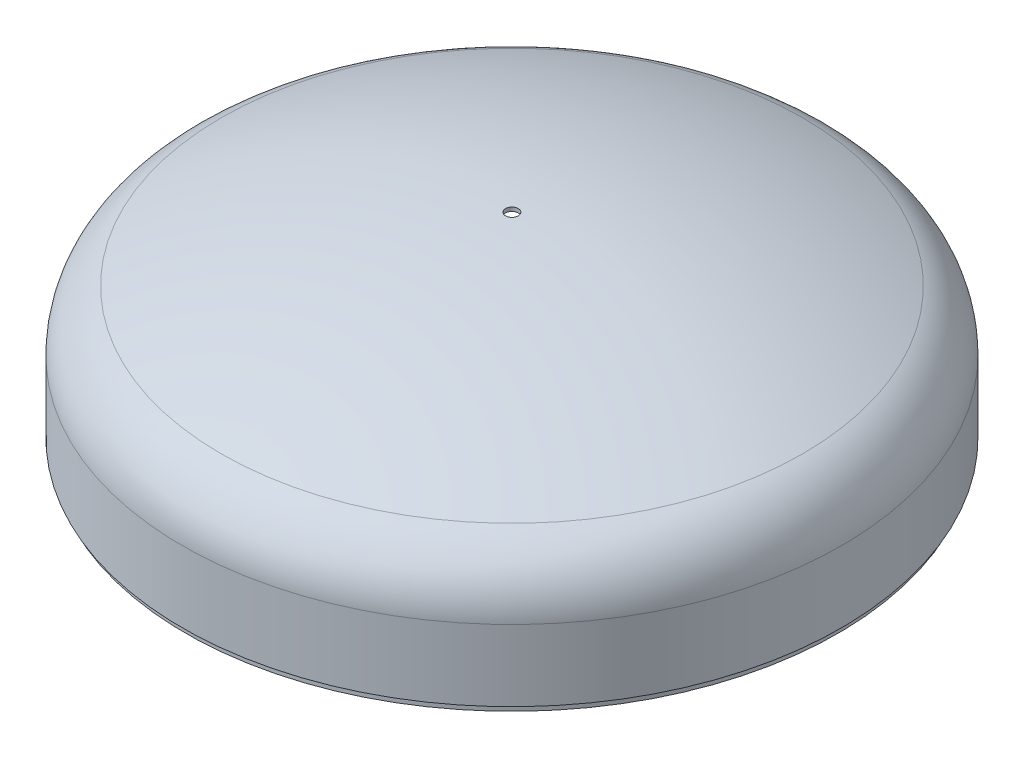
ISO-10303-21;
HEADER;
FILE_DESCRIPTION(('STEP AP214'),'2;1');
FILE_NAME('part.step','',(''),(''),'','','');
FILE_SCHEMA(('AUTOMOTIVE_DESIGN { 1 0 10303 214 1 1 1 1 }'));
ENDSEC;
DATA;
#1=APPLICATION_CONTEXT('core data for automotive mechanical design processes');
#2=APPLICATION_PROTOCOL_DEFINITION('international standard','automotive_design',2000,#1);
#3=PRODUCT_CONTEXT('',#1,'mechanical');
#4=PRODUCT('Part','Part','',(#3));
#5=PRODUCT_RELATED_PRODUCT_CATEGORY('part','',(#4));
#6=PRODUCT_DEFINITION_FORMATION('','',#4);
#7=PRODUCT_DEFINITION_CONTEXT('part definition',#1,'design');
#8=PRODUCT_DEFINITION('design','',#6,#7);
#9=PRODUCT_DEFINITION_SHAPE('','',#8);
#10=(LENGTH_UNIT() NAMED_UNIT(*) SI_UNIT(.MILLI.,.METRE.));
#11=(NAMED_UNIT(*) PLANE_ANGLE_UNIT() SI_UNIT($,.RADIAN.));
#12=(NAMED_UNIT(*) SI_UNIT($,.STERADIAN.) SOLID_ANGLE_UNIT());
#13=UNCERTAINTY_MEASURE_WITH_UNIT(LENGTH_MEASURE(1.E-05),#10,'distance_accuracy_value','');
#14=(GEOMETRIC_REPRESENTATION_CONTEXT(3) GLOBAL_UNCERTAINTY_ASSIGNED_CONTEXT((#13)) GLOBAL_UNIT_ASSIGNED_CONTEXT((#10,
#11,#12)) REPRESENTATION_CONTEXT('',''));
#15=CARTESIAN_POINT('',(0.,0.,0.));
#16=DIRECTION('',(0.,0.,1.));
#17=DIRECTION('',(1.,0.,0.));
#18=AXIS2_PLACEMENT_3D('',#15,#16,#17);
#19=CARTESIAN_POINT('',(0.,0.,0.));
#20=DIRECTION('',(0.,-1.,0.));
#21=DIRECTION('',(1.,0.,0.));
#22=AXIS2_PLACEMENT_3D('',#19,#20,#21);
#23=SPHERICAL_SURFACE('',#22,1100.);
#24=CARTESIAN_POINT('',(0.,1099.95454451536,0.));
#25=DIRECTION('',(0.,-1.,0.));
#26=DIRECTION('',(0.,0.,-1.));
#27=AXIS2_PLACEMENT_3D('',#24,#25,#26);
#28=CIRCLE('',#27,10.);
#29=CARTESIAN_POINT('',(10.0000000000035,1099.95454451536,0.));
#30=VERTEX_POINT('',#29);
#31=EDGE_CURVE('E102',#30,#30,#28,.F.);
#32=CARTESIAN_POINT('',(0.,999.24594180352,0.));
#33=DIRECTION('',(0.,-1.,0.));
#34=DIRECTION('',(0.,0.,-1.));
#35=AXIS2_PLACEMENT_3D('',#32,#33,#34);
#36=CIRCLE('',#35,459.899497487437);
#37=CARTESIAN_POINT('',(459.899497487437,999.24594180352,-1.94024584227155E-12));
#38=VERTEX_POINT('',#37);
#39=EDGE_CURVE('E98',#38,#38,#36,.T.);
#40=CARTESIAN_POINT('',(10.0000000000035,1099.95454451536,0.));
#41=CARTESIAN_POINT('',(14.8380948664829,1099.91056201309,0.));
#42=CARTESIAN_POINT('',(19.6758994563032,1099.83465541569,0.));
#43=CARTESIAN_POINT('',(29.3500859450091,1099.6190160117,-1.2382353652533E-13));
#44=CARTESIAN_POINT('',(34.1864678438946,1099.47928320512,-1.44227494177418E-13));
#45=CARTESIAN_POINT('',(43.8569668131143,1099.13601336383,-1.85025854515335E-13));
#46=CARTESIAN_POINT('',(48.6910838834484,1098.93247632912,-2.05420257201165E-13));
#47=CARTESIAN_POINT('',(58.3562115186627,1098.46163409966,-2.46195956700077E-13));
#48=CARTESIAN_POINT('',(63.1872220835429,1098.1943289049,-2.66577253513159E-13));
#49=CARTESIAN_POINT('',(72.8452955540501,1097.59599672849,-3.07323192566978E-13));
#50=CARTESIAN_POINT('',(77.6723584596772,1097.26496974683,-3.27687834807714E-13));
#51=CARTESIAN_POINT('',(87.3216961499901,1096.53925167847,-3.68396918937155E-13));
#52=CARTESIAN_POINT('',(92.1439709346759,1096.14456059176,-3.8874136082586E-13));
#53=CARTESIAN_POINT('',(101.782892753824,1095.29158302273,-4.29406501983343E-13));
#54=CARTESIAN_POINT('',(106.599539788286,1094.83329654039,-4.49727201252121E-13));
#55=CARTESIAN_POINT('',(116.226367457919,1093.85320797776,-4.90341319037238E-13));
#56=CARTESIAN_POINT('',(121.036548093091,1093.33140589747,-5.10634737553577E-13));
#57=CARTESIAN_POINT('',(130.649605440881,1092.22437699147,-5.51190760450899E-13));
#58=CARTESIAN_POINT('',(135.452482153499,1091.63915016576,-5.71453364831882E-13));
#59=CARTESIAN_POINT('',(145.050095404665,1090.40537366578,-6.11944231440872E-13));
#60=CARTESIAN_POINT('',(149.844831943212,1089.7568239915,-6.32172493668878E-13));
#61=CARTESIAN_POINT('',(159.425330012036,1088.39651471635,-6.72591153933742E-13));
#62=CARTESIAN_POINT('',(164.211091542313,1087.68475511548,-6.92781551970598E-13));
#63=CARTESIAN_POINT('',(173.772806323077,1086.19814991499,-7.33120968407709E-13));
#64=CARTESIAN_POINT('',(178.548759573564,1085.42330431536,-7.53269986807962E-13));
#65=CARTESIAN_POINT('',(188.090026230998,1083.81066202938,-7.93523135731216E-13));
#66=CARTESIAN_POINT('',(192.855339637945,1082.97286534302,-8.13627266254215E-13));
#67=CARTESIAN_POINT('',(202.374496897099,1081.2344667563,-8.53787138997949E-13));
#68=CARTESIAN_POINT('',(207.128340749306,1080.33386485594,-8.73842881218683E-13));
#69=CARTESIAN_POINT('',(216.623731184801,1078.47001264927,-9.13902485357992E-13));
#70=CARTESIAN_POINT('',(221.365277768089,1077.50676234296,-9.33906347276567E-13));
#71=CARTESIAN_POINT('',(230.835248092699,1075.51778104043,-9.73858707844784E-13));
#72=CARTESIAN_POINT('',(235.563671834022,1074.49205004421,-9.93807206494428E-13));
#73=CARTESIAN_POINT('',(245.006573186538,1072.37828595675,-1.03364536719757E-12));
#74=CARTESIAN_POINT('',(249.721050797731,1071.2902528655,-1.05353502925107E-12));
#75=CARTESIAN_POINT('',(259.13523903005,1069.05207403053,-1.09325205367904E-12));
#76=CARTESIAN_POINT('',(263.834949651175,1067.90192828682,-1.1130794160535E-12));
#77=CARTESIAN_POINT('',(273.21878561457,1065.53972440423,-1.1526683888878E-12));
#78=CARTESIAN_POINT('',(277.902910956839,1064.32766626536,-1.17242999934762E-12));
#79=CARTESIAN_POINT('',(287.254760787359,1061.84184862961,-1.21188402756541E-12));
#80=CARTESIAN_POINT('',(291.922485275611,1060.56808913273,-1.23157644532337E-12));
#81=CARTESIAN_POINT('',(301.240720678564,1057.95909056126,-1.27088865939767E-12));
#82=CARTESIAN_POINT('',(305.891231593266,1056.62385148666,-1.290508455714E-12));
#83=CARTESIAN_POINT('',(315.174230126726,1053.89212624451,-1.32967201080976E-12));
#84=CARTESIAN_POINT('',(319.806717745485,1052.49564007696,-1.34921576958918E-12));
#85=CARTESIAN_POINT('',(329.052863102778,1049.6416637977,-1.38822384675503E-12));
#86=CARTESIAN_POINT('',(333.666520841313,1048.18417368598,-1.40768816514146E-12));
#87=CARTESIAN_POINT('',(342.874203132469,1045.20844328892,-1.44653397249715E-12));
#88=CARTESIAN_POINT('',(347.46822768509,1043.69020300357,-1.4659154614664E-12));
#89=CARTESIAN_POINT('',(356.635843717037,1040.59323660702,-1.50459223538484E-12));
#90=CARTESIAN_POINT('',(361.209435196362,1039.0145104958,-1.52388752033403E-12));
#91=CARTESIAN_POINT('',(370.335388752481,1035.79684732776,-1.56238852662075E-12));
#92=CARTESIAN_POINT('',(374.887750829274,1034.15791027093,-1.58159424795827E-12));
#93=CARTESIAN_POINT('',(383.970452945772,1030.82011057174,-1.61991278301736E-12));
#94=CARTESIAN_POINT('',(388.500792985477,1029.12124792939,-1.63902559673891E-12));
#95=CARTESIAN_POINT('',(397.53866223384,1025.66389286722,-1.67715498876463E-12));
#96=CARTESIAN_POINT('',(402.046191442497,1023.90540044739,-1.69617156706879E-12));
#97=CARTESIAN_POINT('',(411.037654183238,1020.3290919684,-1.73410517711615E-12));
#98=CARTESIAN_POINT('',(415.521587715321,1018.51127590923,-1.75302220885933E-12));
#99=CARTESIAN_POINT('',(424.465078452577,1014.81663681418,-1.79075343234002E-12));
#100=CARTESIAN_POINT('',(428.92463565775,1012.93981377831,-1.80956762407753E-12));
#101=CARTESIAN_POINT('',(437.818597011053,1009.12748693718,-1.84708989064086E-12));
#102=CARTESIAN_POINT('',(442.253001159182,1007.19198313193,-1.8657979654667E-12));
#103=CARTESIAN_POINT('',(451.095885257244,1003.2626338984,-1.90310474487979E-12));
#104=CARTESIAN_POINT('',(455.504365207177,1001.26878847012,-1.92170344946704E-12));
#105=CARTESIAN_POINT('',(459.899497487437,999.24594180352,-1.94024584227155E-12));
#106=B_SPLINE_CURVE_WITH_KNOTS('',3,(#40,#41,#42,#43,#44,#45,#46,#47,#48,#49,#50,#51,#52,#53,
#54,#55,#56,#57,#58,#59,#60,#61,#62,#63,#64,#65,#66,#67,#68,#69,#70,#71,#72,#73,#74,#75,#76,#77,
#78,#79,#80,#81,#82,#83,#84,#85,#86,#87,#88,#89,#90,#91,#92,#93,#94,#95,#96,#97,#98,#99,#100,
#101,#102,#103,#104,#105),.UNSPECIFIED.,.F.,.F.,(4,2,2,2,2,2,2,2,2,2,2,2,2,2,2,2,2,2,2,2,2,2,2,
2,2,2,2,2,2,2,2,2,4),(0.,14.5147789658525,29.029557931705,43.5443368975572,58.0591158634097,
72.5738948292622,87.0886737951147,101.603452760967,116.118231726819,130.633010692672,
145.147789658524,159.662568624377,174.177347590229,188.692126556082,203.206905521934,
217.721684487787,232.236463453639,246.751242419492,261.266021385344,275.780800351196,
290.295579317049,304.810358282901,319.325137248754,333.839916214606,348.354695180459,
362.869474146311,377.384253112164,391.899032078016,406.413811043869,420.928590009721,
435.443368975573,449.958147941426,464.472926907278),.UNSPECIFIED.);
#107=EDGE_CURVE('BSEAM50',#30,#38,#106,.T.);
#108=ORIENTED_EDGE('',*,*,#31,.F.);
#109=ORIENTED_EDGE('',*,*,#39,.F.);
#110=ORIENTED_EDGE('',*,*,#107,.T.);
#111=ORIENTED_EDGE('',*,*,#107,.F.);
#112=EDGE_LOOP('',(#108,#110,#109,#111));
#113=FACE_BOUND('',#112,.T.);
#114=ADVANCED_FACE('F50',(#113),#23,.T.);
#115=CARTESIAN_POINT('',(0.,0.,0.));
#116=DIRECTION('',(0.,-1.,0.));
#117=DIRECTION('',(1.,0.,0.));
#118=AXIS2_PLACEMENT_3D('',#115,#116,#117);
#119=SPHERICAL_SURFACE('',#118,1094.);
#120=CARTESIAN_POINT('',(0.,1093.95429520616,0.));
#121=DIRECTION('',(0.,-1.,0.));
#122=DIRECTION('',(0.,0.,-1.));
#123=AXIS2_PLACEMENT_3D('',#120,#121,#122);
#124=CIRCLE('',#123,10.);
#125=CARTESIAN_POINT('',(10.0000000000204,1093.95429520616,0.));
#126=VERTEX_POINT('',#125);
#127=EDGE_CURVE('E53',#126,#126,#124,.F.);
#128=CARTESIAN_POINT('',(0.,995.859022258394,0.));
#129=DIRECTION('',(0.,-1.,0.));
#130=DIRECTION('',(0.,0.,-1.));
#131=AXIS2_PLACEMENT_3D('',#128,#129,#130);
#132=CIRCLE('',#131,452.880566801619);
#133=CARTESIAN_POINT('',(452.88056680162,995.859022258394,-1.91063404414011E-12));
#134=VERTEX_POINT('',#133);
#135=EDGE_CURVE('E12',#134,#134,#132,.T.);
#136=CARTESIAN_POINT('',(10.0000000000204,1093.95429520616,0.));
#137=CARTESIAN_POINT('',(14.7594702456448,1093.91079007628,0.));
#138=CARTESIAN_POINT('',(19.5186564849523,1093.83622065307,0.));
#139=CARTESIAN_POINT('',(29.0356503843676,1093.62497426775,-1.22496980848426E-13));
#140=CARTESIAN_POINT('',(33.7934580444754,1093.48829730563,-1.42569445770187E-13));
#141=CARTESIAN_POINT('',(43.3068842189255,1093.1528568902,-1.82705139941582E-13));
#142=CARTESIAN_POINT('',(48.0625027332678,1092.95409343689,-2.02768369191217E-13));
#143=CARTESIAN_POINT('',(57.5707404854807,1092.49451449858,-2.42882174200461E-13));
#144=CARTESIAN_POINT('',(62.3233597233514,1092.23369901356,-2.62932749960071E-13));
#145=CARTESIAN_POINT('',(71.8247892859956,1091.65006028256,-3.03017832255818E-13));
#146=CARTESIAN_POINT('',(76.5735996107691,1091.32723703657,-3.23052338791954E-13));
#147=CARTESIAN_POINT('',(86.0666023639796,1090.61963782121,-3.63101869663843E-13));
#148=CARTESIAN_POINT('',(90.8107947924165,1090.23486185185,-3.83116893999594E-13));
#149=CARTESIAN_POINT('',(100.293753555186,1089.40342272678,-4.23124050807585E-13));
#150=CARTESIAN_POINT('',(105.032519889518,1088.95675957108,-4.43116183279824E-13));
#151=CARTESIAN_POINT('',(114.503819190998,1088.00162216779,-4.83074150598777E-13));
#152=CARTESIAN_POINT('',(119.236352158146,1087.4931479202,-5.03039985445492E-13));
#153=CARTESIAN_POINT('',(128.694378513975,1086.4144749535,-5.42941956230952E-13));
#154=CARTESIAN_POINT('',(133.419871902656,1085.84427623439,-5.62878092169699E-13));
#155=CARTESIAN_POINT('',(142.863014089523,1084.64225146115,-6.02717268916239E-13));
#156=CARTESIAN_POINT('',(147.580662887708,1084.01042540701,-6.22620309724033E-13));
#157=CARTESIAN_POINT('',(157.007312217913,1082.68525359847,-6.62389905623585E-13));
#158=CARTESIAN_POINT('',(161.716312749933,1081.99190784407,-6.82256460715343E-13));
#159=CARTESIAN_POINT('',(171.124863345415,1080.54381475,-7.21949700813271E-13));
#160=CARTESIAN_POINT('',(175.824413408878,1079.78906741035,-7.41776385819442E-13));
#161=CARTESIAN_POINT('',(185.213262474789,1078.21829972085,-7.81386508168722E-13));
#162=CARTESIAN_POINT('',(189.902561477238,1077.40227937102,-8.01169945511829E-13));
#163=CARTESIAN_POINT('',(199.270109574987,1075.70910467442,-8.40690202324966E-13));
#164=CARTESIAN_POINT('',(203.948358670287,1074.83195032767,-8.60427021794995E-13));
#165=CARTESIAN_POINT('',(213.293009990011,1073.01665706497,-8.99850680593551E-13));
#166=CARTESIAN_POINT('',(217.959412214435,1072.07851814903,-9.19537519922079E-13));
#167=CARTESIAN_POINT('',(227.279574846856,1070.14141556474,-9.58857864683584E-13));
#168=CARTESIAN_POINT('',(231.933335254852,1069.1424518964,-9.78491370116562E-13));
#169=CARTESIAN_POINT('',(241.227421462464,1067.08386998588,-1.01770170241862E-12));
#170=CARTESIAN_POINT('',(245.86774726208,1066.02425174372,-1.0372785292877E-12));
#171=CARTESIAN_POINT('',(255.134173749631,1063.84454119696,-1.07637216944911E-12));
#172=CARTESIAN_POINT('',(259.760274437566,1062.72444889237,-1.09588898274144E-12));
#173=CARTESIAN_POINT('',(268.997462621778,1060.42398103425,-1.13485927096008E-12));
#174=CARTESIAN_POINT('',(273.608550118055,1059.24360548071,-1.15431274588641E-12));
#175=CARTESIAN_POINT('',(282.814926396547,1056.82277220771,-1.19315304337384E-12));
#176=CARTESIAN_POINT('',(287.410215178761,1055.58231448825,-1.21253986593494E-12));
#177=CARTESIAN_POINT('',(296.584211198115,1053.04152820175,-1.25124355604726E-12));
#178=CARTESIAN_POINT('',(301.162918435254,1051.7411996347,-1.27056042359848E-12));
#179=CARTESIAN_POINT('',(310.302971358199,1049.08089317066,-1.3091209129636E-12));
#180=CARTESIAN_POINT('',(314.864317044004,1047.72091527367,-1.32836453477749E-12));
#181=CARTESIAN_POINT('',(323.968869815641,1044.94154182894,-1.36677525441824E-12));
#182=CARTESIAN_POINT('',(328.512076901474,1043.5221462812,-1.3859423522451E-12));
#183=CARTESIAN_POINT('',(337.579578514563,1040.62417933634,-1.42419675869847E-12));
#184=CARTESIAN_POINT('',(342.103873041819,1039.14560793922,-1.44328406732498E-12));
#185=CARTESIAN_POINT('',(351.13277880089,1036.12954117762,-1.48137564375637E-12));
#186=CARTESIAN_POINT('',(355.637390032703,1034.59204581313,-1.50037991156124E-12));
#187=CARTESIAN_POINT('',(364.626161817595,1031.45839303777,-1.53830216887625E-12));
#188=CARTESIAN_POINT('',(369.110322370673,1029.8622356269,-1.5572201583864E-12));
#189=CARTESIAN_POINT('',(378.057428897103,1026.61153066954,-1.59496663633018E-12));
#190=CARTESIAN_POINT('',(382.520374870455,1024.95698312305,-1.61379512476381E-12));
#191=CARTESIAN_POINT('',(391.424291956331,1021.58977976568,-1.65135939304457E-12));
#192=CARTESIAN_POINT('',(395.865263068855,1019.8771239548,-1.67009517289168E-12));
#193=CARTESIAN_POINT('',(404.724473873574,1016.39399578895,-1.70747083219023E-12));
#194=CARTESIAN_POINT('',(409.142713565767,1014.62352343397,-1.72611071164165E-12));
#195=CARTESIAN_POINT('',(417.955708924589,1011.025063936,-1.76329139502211E-12));
#196=CARTESIAN_POINT('',(422.350464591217,1009.197076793,-1.78183219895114E-12));
#197=CARTESIAN_POINT('',(431.11574298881,1005.48389857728,-1.81881157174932E-12));
#198=CARTESIAN_POINT('',(435.486265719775,1003.59870750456,-1.83725014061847E-12));
#199=CARTESIAN_POINT('',(444.202334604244,999.771444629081,-1.87402190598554E-12));
#200=CARTESIAN_POINT('',(448.547880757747,997.829372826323,-1.89235510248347E-12));
#201=CARTESIAN_POINT('',(452.88056680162,995.859022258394,-1.91063404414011E-12));
#202=B_SPLINE_CURVE_WITH_KNOTS('',3,(#136,#137,#138,#139,#140,#141,#142,#143,#144,#145,#146,
#147,#148,#149,#150,#151,#152,#153,#154,#155,#156,#157,#158,#159,#160,#161,#162,#163,#164,#165,
#166,#167,#168,#169,#170,#171,#172,#173,#174,#175,#176,#177,#178,#179,#180,#181,#182,#183,#184,
#185,#186,#187,#188,#189,#190,#191,#192,#193,#194,#195,#196,#197,#198,#199,#200,#201),
.UNSPECIFIED.,.F.,.F.,(4,2,2,2,2,2,2,2,2,2,2,2,2,2,2,2,2,2,2,2,2,2,2,2,2,2,2,2,2,2,2,2,4),(0.,
14.2789058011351,28.5578116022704,42.8367174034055,57.1156232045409,71.394529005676,
85.6734348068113,99.9523406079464,114.231246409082,128.510152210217,142.789058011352,
157.067963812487,171.346869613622,185.625775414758,199.904681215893,214.183587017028,
228.462492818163,242.741398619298,257.020304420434,271.299210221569,285.578116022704,
299.857021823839,314.135927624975,328.41483342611,342.693739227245,356.97264502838,
371.251550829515,385.530456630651,399.809362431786,414.088268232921,428.367174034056,
442.646079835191,456.924985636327),.UNSPECIFIED.);
#203=EDGE_CURVE('BSEAM113',#126,#134,#202,.T.);
#204=ORIENTED_EDGE('',*,*,#127,.T.);
#205=ORIENTED_EDGE('',*,*,#135,.T.);
#206=ORIENTED_EDGE('',*,*,#203,.T.);
#207=ORIENTED_EDGE('',*,*,#203,.F.);
#208=EDGE_LOOP('',(#204,#206,#205,#207));
#209=FACE_BOUND('',#208,.T.);
#210=ADVANCED_FACE('F113',(#209),#119,.F.);
#211=CARTESIAN_POINT('',(-1.31838984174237E-13,899.368111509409,0.));
#212=DIRECTION('',(0.,-1.,0.));
#213=DIRECTION('',(0.,0.,-1.));
#214=AXIS2_PLACEMENT_3D('',#211,#212,#213);
#215=TOROIDAL_SURFACE('',#214,409.,106.);
#216=CARTESIAN_POINT('',(-1.31838984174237E-13,899.368111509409,0.));
#217=DIRECTION('',(0.,-1.,0.));
#218=DIRECTION('',(0.,0.,-1.));
#219=AXIS2_PLACEMENT_3D('',#216,#217,#218);
#220=CIRCLE('',#219,515.);
#221=CARTESIAN_POINT('',(2.04086747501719E-12,899.368111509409,-515.));
#222=VERTEX_POINT('',#221);
#223=EDGE_CURVE('E58',#222,#222,#220,.T.);
#224=ORIENTED_EDGE('',*,*,#223,.T.);
#225=EDGE_LOOP('',(#224));
#226=FACE_BOUND('',#225,.T.);
#227=ORIENTED_EDGE('',*,*,#135,.F.);
#228=EDGE_LOOP('',(#227));
#229=FACE_BOUND('',#228,.T.);
#230=ADVANCED_FACE('F130',(#226,#229),#215,.F.);
#231=CARTESIAN_POINT('',(0.,0.,0.));
#232=DIRECTION('',(0.,-1.,0.));
#233=DIRECTION('',(0.,0.,-1.));
#234=AXIS2_PLACEMENT_3D('',#231,#232,#233);
#235=CYLINDRICAL_SURFACE('',#234,515.);
#236=CARTESIAN_POINT('',(0.,793.374314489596,0.));
#237=DIRECTION('',(0.,-1.,0.));
#238=DIRECTION('',(0.,0.,-1.));
#239=AXIS2_PLACEMENT_3D('',#236,#237,#238);
#240=CIRCLE('',#239,515.);
#241=CARTESIAN_POINT('',(2.17270645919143E-12,793.374314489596,-515.));
#242=VERTEX_POINT('',#241);
#243=EDGE_CURVE('E64',#242,#242,#240,.T.);
#244=ORIENTED_EDGE('',*,*,#243,.T.);
#245=EDGE_LOOP('',(#244));
#246=FACE_BOUND('',#245,.T.);
#247=ORIENTED_EDGE('',*,*,#223,.F.);
#248=EDGE_LOOP('',(#247));
#249=FACE_BOUND('',#248,.T.);
#250=ADVANCED_FACE('F137',(#246,#249),#235,.F.);
#251=CARTESIAN_POINT('',(0.,791.240339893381,0.));
#252=DIRECTION('',(0.,1.,0.));
#253=DIRECTION('',(0.,0.,1.));
#254=AXIS2_PLACEMENT_3D('',#251,#252,#253);
#255=CONICAL_SURFACE('',#254,511.303847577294,1.04719755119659);
#256=ORIENTED_EDGE('',*,*,#243,.F.);
#257=EDGE_LOOP('',(#256));
#258=FACE_BOUND('',#257,.T.);
#259=CARTESIAN_POINT('',(0.,791.240339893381,0.));
#260=DIRECTION('',(0.,-1.,0.));
#261=DIRECTION('',(0.,0.,-1.));
#262=AXIS2_PLACEMENT_3D('',#259,#260,#261);
#263=CIRCLE('',#262,511.303847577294);
#264=CARTESIAN_POINT('',(2.15711295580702E-12,791.240339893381,-511.303847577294));
#265=VERTEX_POINT('',#264);
#266=EDGE_CURVE('E70',#265,#265,#263,.T.);
#267=ORIENTED_EDGE('',*,*,#266,.T.);
#268=EDGE_LOOP('',(#267));
#269=FACE_BOUND('',#268,.T.);
#270=ADVANCED_FACE('F143',(#258,#269),#255,.F.);
#271=CARTESIAN_POINT('',(0.,788.642263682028,0.));
#272=DIRECTION('',(0.,-1.,0.));
#273=DIRECTION('',(0.,0.,-1.));
#274=AXIS2_PLACEMENT_3D('',#271,#272,#273);
#275=TOROIDAL_SURFACE('',#274,512.803847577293,2.99999999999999);
#276=ORIENTED_EDGE('',*,*,#266,.F.);
#277=EDGE_LOOP('',(#276));
#278=FACE_BOUND('',#277,.T.);
#279=CARTESIAN_POINT('',(0.,788.642263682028,0.));
#280=DIRECTION('',(0.,-1.,0.));
#281=DIRECTION('',(0.,0.,-1.));
#282=AXIS2_PLACEMENT_3D('',#279,#280,#281);
#283=CIRCLE('',#282,509.803847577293);
#284=CARTESIAN_POINT('',(2.15078468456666E-12,788.642263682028,-509.803847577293));
#285=VERTEX_POINT('',#284);
#286=EDGE_CURVE('E74',#285,#285,#283,.T.);
#287=ORIENTED_EDGE('',*,*,#286,.T.);
#288=EDGE_LOOP('',(#287));
#289=FACE_BOUND('',#288,.T.);
#290=ADVANCED_FACE('F147',(#278,#289),#275,.T.);
#291=CARTESIAN_POINT('',(0.,0.,0.));
#292=DIRECTION('',(0.,-1.,0.));
#293=DIRECTION('',(0.,0.,-1.));
#294=AXIS2_PLACEMENT_3D('',#291,#292,#293);
#295=CYLINDRICAL_SURFACE('',#294,509.803847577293);
#296=ORIENTED_EDGE('',*,*,#286,.F.);
#297=EDGE_LOOP('',(#296));
#298=FACE_BOUND('',#297,.T.);
#299=CARTESIAN_POINT('',(0.,781.374314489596,0.));
#300=DIRECTION('',(0.,-1.,0.));
#301=DIRECTION('',(0.,0.,-1.));
#302=AXIS2_PLACEMENT_3D('',#299,#300,#301);
#303=CIRCLE('',#302,509.803847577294);
#304=CARTESIAN_POINT('',(2.15078468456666E-12,781.374314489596,-509.803847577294));
#305=VERTEX_POINT('',#304);
#306=EDGE_CURVE('E78',#305,#305,#303,.T.);
#307=ORIENTED_EDGE('',*,*,#306,.T.);
#308=EDGE_LOOP('',(#307));
#309=FACE_BOUND('',#308,.T.);
#310=ADVANCED_FACE('F151',(#298,#309),#295,.F.);
#311=CARTESIAN_POINT('',(515.803847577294,781.374314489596,-2.1094237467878E-12));
#312=DIRECTION('',(0.,1.,0.));
#313=DIRECTION('',(0.,0.,1.));
#314=AXIS2_PLACEMENT_3D('',#311,#312,#313);
#315=PLANE('',#314);
#316=ORIENTED_EDGE('',*,*,#306,.F.);
#317=EDGE_LOOP('',(#316));
#318=FACE_BOUND('',#317,.T.);
#319=CARTESIAN_POINT('',(0.,781.374314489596,0.));
#320=DIRECTION('',(0.,-1.,0.));
#321=DIRECTION('',(0.,0.,-1.));
#322=AXIS2_PLACEMENT_3D('',#319,#320,#321);
#323=CIRCLE('',#322,515.803847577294);
#324=CARTESIAN_POINT('',(2.17609776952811E-12,781.374314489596,-515.803847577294));
#325=VERTEX_POINT('',#324);
#326=EDGE_CURVE('E82',#325,#325,#323,.T.);
#327=ORIENTED_EDGE('',*,*,#326,.T.);
#328=EDGE_LOOP('',(#327));
#329=FACE_BOUND('',#328,.T.);
#330=ADVANCED_FACE('F155',(#318,#329),#315,.F.);
#331=CARTESIAN_POINT('',(0.,0.,0.));
#332=DIRECTION('',(0.,-1.,0.));
#333=DIRECTION('',(0.,0.,-1.));
#334=AXIS2_PLACEMENT_3D('',#331,#332,#333);
#335=CYLINDRICAL_SURFACE('',#334,515.803847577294);
#336=ORIENTED_EDGE('',*,*,#326,.F.);
#337=EDGE_LOOP('',(#336));
#338=FACE_BOUND('',#337,.T.);
#339=CARTESIAN_POINT('',(0.,788.374314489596,0.));
#340=DIRECTION('',(0.,-1.,0.));
#341=DIRECTION('',(0.,0.,-1.));
#342=AXIS2_PLACEMENT_3D('',#339,#340,#341);
#343=CIRCLE('',#342,515.803847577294);
#344=CARTESIAN_POINT('',(2.17609776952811E-12,788.374314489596,-515.803847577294));
#345=VERTEX_POINT('',#344);
#346=EDGE_CURVE('E86',#345,#345,#343,.T.);
#347=ORIENTED_EDGE('',*,*,#346,.T.);
#348=EDGE_LOOP('',(#347));
#349=FACE_BOUND('',#348,.T.);
#350=ADVANCED_FACE('F159',(#338,#349),#335,.T.);
#351=CARTESIAN_POINT('',(0.,791.374314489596,0.));
#352=DIRECTION('',(0.,1.,0.));
#353=DIRECTION('',(0.,0.,1.));
#354=AXIS2_PLACEMENT_3D('',#351,#352,#353);
#355=CONICAL_SURFACE('',#354,521.,1.04719755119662);
#356=ORIENTED_EDGE('',*,*,#346,.F.);
#357=EDGE_LOOP('',(#356));
#358=FACE_BOUND('',#357,.T.);
#359=CARTESIAN_POINT('',(0.,791.374314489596,0.));
#360=DIRECTION('',(0.,-1.,0.));
#361=DIRECTION('',(0.,0.,-1.));
#362=AXIS2_PLACEMENT_3D('',#359,#360,#361);
#363=CIRCLE('',#362,521.);
#364=CARTESIAN_POINT('',(2.19801954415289E-12,791.374314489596,-521.));
#365=VERTEX_POINT('',#364);
#366=EDGE_CURVE('E90',#365,#365,#363,.T.);
#367=ORIENTED_EDGE('',*,*,#366,.T.);
#368=EDGE_LOOP('',(#367));
#369=FACE_BOUND('',#368,.T.);
#370=ADVANCED_FACE('F163',(#358,#369),#355,.T.);
#371=CARTESIAN_POINT('',(0.,0.,0.));
#372=DIRECTION('',(0.,-1.,0.));
#373=DIRECTION('',(0.,0.,-1.));
#374=AXIS2_PLACEMENT_3D('',#371,#372,#373);
#375=CYLINDRICAL_SURFACE('',#374,521.);
#376=ORIENTED_EDGE('',*,*,#366,.F.);
#377=EDGE_LOOP('',(#376));
#378=FACE_BOUND('',#377,.T.);
#379=CARTESIAN_POINT('',(-1.31838984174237E-13,903.863374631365,0.));
#380=DIRECTION('',(0.,-1.,0.));
#381=DIRECTION('',(0.,0.,-1.));
#382=AXIS2_PLACEMENT_3D('',#379,#380,#381);
#383=CIRCLE('',#382,521.);
#384=CARTESIAN_POINT('',(2.06618055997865E-12,903.863374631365,-521.));
#385=VERTEX_POINT('',#384);
#386=EDGE_CURVE('E94',#385,#385,#383,.T.);
#387=ORIENTED_EDGE('',*,*,#386,.T.);
#388=EDGE_LOOP('',(#387));
#389=FACE_BOUND('',#388,.T.);
#390=ADVANCED_FACE('F122',(#378,#389),#375,.T.);
#391=CARTESIAN_POINT('',(-1.31838984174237E-13,903.863374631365,0.));
#392=DIRECTION('',(0.,-1.,0.));
#393=DIRECTION('',(0.,0.,-1.));
#394=AXIS2_PLACEMENT_3D('',#391,#392,#393);
#395=TOROIDAL_SURFACE('',#394,416.,105.);
#396=ORIENTED_EDGE('',*,*,#386,.F.);
#397=EDGE_LOOP('',(#396));
#398=FACE_BOUND('',#397,.T.);
#399=ORIENTED_EDGE('',*,*,#39,.T.);
#400=EDGE_LOOP('',(#399));
#401=FACE_BOUND('',#400,.T.);
#402=ADVANCED_FACE('F117',(#398,#401),#395,.T.);
#403=CARTESIAN_POINT('',(0.,781.374314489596,0.));
#404=DIRECTION('',(0.,1.,0.));
#405=DIRECTION('',(0.,0.,1.));
#406=AXIS2_PLACEMENT_3D('',#403,#404,#405);
#407=CYLINDRICAL_SURFACE('',#406,10.);
#408=ORIENTED_EDGE('',*,*,#31,.T.);
#409=EDGE_LOOP('',(#408));
#410=FACE_BOUND('',#409,.T.);
#411=ORIENTED_EDGE('',*,*,#127,.F.);
#412=EDGE_LOOP('',(#411));
#413=FACE_BOUND('',#412,.T.);
#414=ADVANCED_FACE('F115',(#410,#413),#407,.F.);
#415=CLOSED_SHELL('',(#114,#210,#230,#250,#270,#290,#310,#330,#350,#370,#390,#402,#414));
#416=MANIFOLD_SOLID_BREP('B2',#415);
#417=ADVANCED_BREP_SHAPE_REPRESENTATION('',(#18,#416),#14);
#418=SHAPE_DEFINITION_REPRESENTATION(#9,#417);
ENDSEC;
END-ISO-10303-21;
